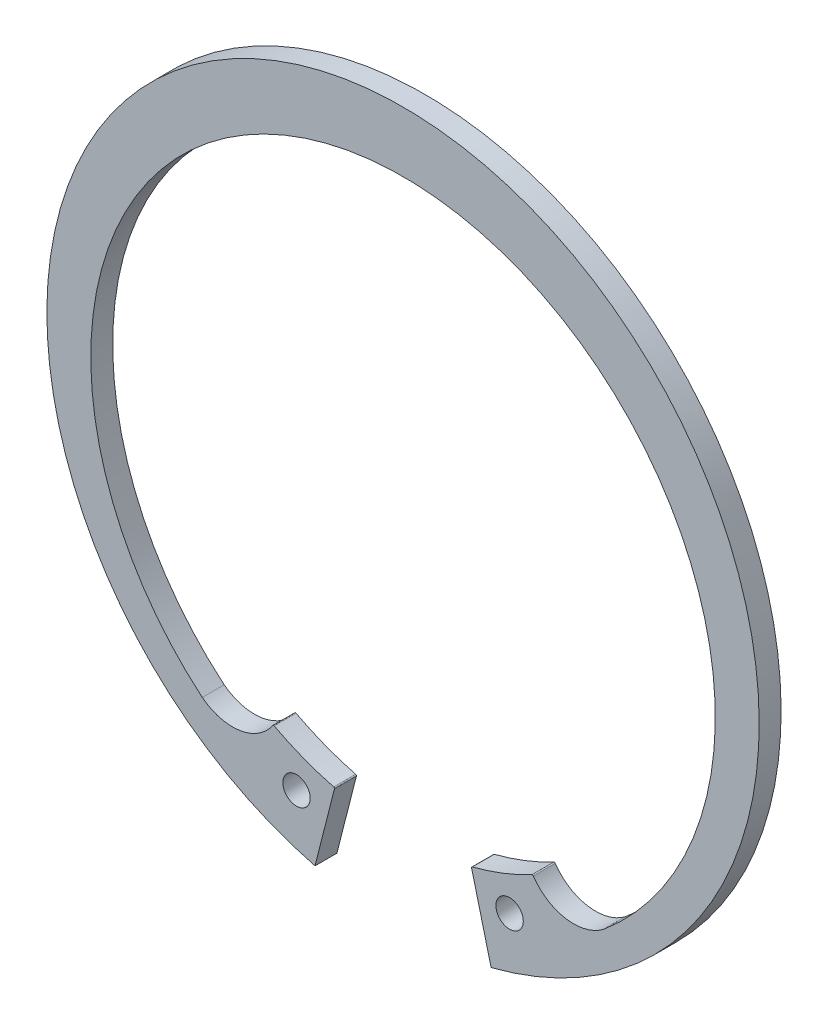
ISO-10303-21;
HEADER;
FILE_DESCRIPTION(('STEP AP214'),'2;1');
FILE_NAME('part.step','',(''),(''),'','','');
FILE_SCHEMA(('AUTOMOTIVE_DESIGN { 1 0 10303 214 1 1 1 1 }'));
ENDSEC;
DATA;
#1=APPLICATION_CONTEXT('core data for automotive mechanical design processes');
#2=APPLICATION_PROTOCOL_DEFINITION('international standard','automotive_design',2000,#1);
#3=PRODUCT_CONTEXT('',#1,'mechanical');
#4=PRODUCT('Part','Part','',(#3));
#5=PRODUCT_RELATED_PRODUCT_CATEGORY('part','',(#4));
#6=PRODUCT_DEFINITION_FORMATION('','',#4);
#7=PRODUCT_DEFINITION_CONTEXT('part definition',#1,'design');
#8=PRODUCT_DEFINITION('design','',#6,#7);
#9=PRODUCT_DEFINITION_SHAPE('','',#8);
#10=(LENGTH_UNIT() NAMED_UNIT(*) SI_UNIT(.MILLI.,.METRE.));
#11=(NAMED_UNIT(*) PLANE_ANGLE_UNIT() SI_UNIT($,.RADIAN.));
#12=(NAMED_UNIT(*) SI_UNIT($,.STERADIAN.) SOLID_ANGLE_UNIT());
#13=UNCERTAINTY_MEASURE_WITH_UNIT(LENGTH_MEASURE(1.E-05),#10,'distance_accuracy_value','');
#14=(GEOMETRIC_REPRESENTATION_CONTEXT(3) GLOBAL_UNCERTAINTY_ASSIGNED_CONTEXT((#13)) GLOBAL_UNIT_ASSIGNED_CONTEXT((#10,
#11,#12)) REPRESENTATION_CONTEXT('',''));
#15=CARTESIAN_POINT('',(0.,0.,0.));
#16=DIRECTION('',(0.,0.,1.));
#17=DIRECTION('',(1.,0.,0.));
#18=AXIS2_PLACEMENT_3D('',#15,#16,#17);
#19=CARTESIAN_POINT('',(0.,0.,-2.));
#20=DIRECTION('',(0.,0.,1.));
#21=DIRECTION('',(1.,0.,0.));
#22=AXIS2_PLACEMENT_3D('',#19,#20,#21);
#23=CYLINDRICAL_SURFACE('',#22,32.5);
#24=CARTESIAN_POINT('',(0.,0.,-2.));
#25=DIRECTION('',(0.,0.,1.));
#26=DIRECTION('',(1.,0.,0.));
#27=AXIS2_PLACEMENT_3D('',#24,#25,#26);
#28=CIRCLE('',#27,32.5);
#29=CARTESIAN_POINT('',(8.03676944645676,-31.4906388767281,-2.));
#30=VERTEX_POINT('',#29);
#31=CARTESIAN_POINT('',(-8.03676944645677,-31.4906388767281,-2.));
#32=VERTEX_POINT('',#31);
#33=EDGE_CURVE('E50',#30,#32,#28,.T.);
#34=ORIENTED_EDGE('',*,*,#33,.T.);
#35=DIRECTION('',(0.,0.,1.));
#36=VECTOR('',#35,1.);
#37=CARTESIAN_POINT('',(-8.03676944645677,-31.4906388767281,-2.));
#38=LINE('',#37,#36);
#39=CARTESIAN_POINT('',(-8.03676944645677,-31.4906388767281,0.));
#40=VERTEX_POINT('',#39);
#41=EDGE_CURVE('E37',#32,#40,#38,.T.);
#42=ORIENTED_EDGE('',*,*,#41,.T.);
#43=CARTESIAN_POINT('',(0.,0.,0.));
#44=DIRECTION('',(0.,0.,1.));
#45=DIRECTION('',(1.,0.,0.));
#46=AXIS2_PLACEMENT_3D('',#43,#44,#45);
#47=CIRCLE('',#46,32.5);
#48=CARTESIAN_POINT('',(8.03676944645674,-31.4906388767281,0.));
#49=VERTEX_POINT('',#48);
#50=EDGE_CURVE('E139',#49,#40,#47,.T.);
#51=ORIENTED_EDGE('',*,*,#50,.F.);
#52=DIRECTION('',(0.,0.,1.));
#53=VECTOR('',#52,1.);
#54=CARTESIAN_POINT('',(8.03676944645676,-31.4906388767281,-2.));
#55=LINE('',#54,#53);
#56=EDGE_CURVE('E11',#30,#49,#55,.T.);
#57=ORIENTED_EDGE('',*,*,#56,.F.);
#58=EDGE_LOOP('',(#34,#42,#51,#57));
#59=FACE_BOUND('',#58,.T.);
#60=ADVANCED_FACE('F34',(#59),#23,.T.);
#61=CARTESIAN_POINT('',(8.03676944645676,-31.4906388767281,-2.));
#62=DIRECTION('',(-0.968942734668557,-0.247285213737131,0.));
#63=DIRECTION('',(0.24728521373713,-0.968942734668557,0.));
#64=AXIS2_PLACEMENT_3D('',#61,#62,#63);
#65=PLANE('',#64);
#66=DIRECTION('',(0.24728521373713,-0.968942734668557,0.));
#67=VECTOR('',#66,1.);
#68=CARTESIAN_POINT('',(8.03676944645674,-31.4906388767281,0.));
#69=LINE('',#68,#67);
#70=CARTESIAN_POINT('',(6.25626703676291,-24.5140596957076,0.));
#71=VERTEX_POINT('',#70);
#72=EDGE_CURVE('E247',#71,#49,#69,.T.);
#73=ORIENTED_EDGE('',*,*,#72,.F.);
#74=DIRECTION('',(0.,0.,1.));
#75=VECTOR('',#74,1.);
#76=CARTESIAN_POINT('',(6.25626703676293,-24.5140596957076,-2.));
#77=LINE('',#76,#75);
#78=CARTESIAN_POINT('',(6.25626703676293,-24.5140596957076,-2.));
#79=VERTEX_POINT('',#78);
#80=EDGE_CURVE('E217',#79,#71,#77,.T.);
#81=ORIENTED_EDGE('',*,*,#80,.F.);
#82=DIRECTION('',(0.24728521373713,-0.968942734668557,0.));
#83=VECTOR('',#82,1.);
#84=CARTESIAN_POINT('',(8.03676944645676,-31.4906388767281,-2.));
#85=LINE('',#84,#83);
#86=EDGE_CURVE('E253',#79,#30,#85,.T.);
#87=ORIENTED_EDGE('',*,*,#86,.T.);
#88=ORIENTED_EDGE('',*,*,#56,.T.);
#89=EDGE_LOOP('',(#73,#81,#87,#88));
#90=FACE_BOUND('',#89,.T.);
#91=ADVANCED_FACE('F302',(#90),#65,.T.);
#92=CARTESIAN_POINT('',(0.,-1.49460272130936,-2.));
#93=DIRECTION('',(0.,0.,1.));
#94=DIRECTION('',(1.,0.,0.));
#95=AXIS2_PLACEMENT_3D('',#92,#93,#94);
#96=CYLINDRICAL_SURFACE('',#95,28.4946027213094);
#97=DIRECTION('',(0.,0.,1.));
#98=VECTOR('',#97,1.);
#99=CARTESIAN_POINT('',(-18.3186678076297,-23.3204771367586,-2.));
#100=LINE('',#99,#98);
#101=CARTESIAN_POINT('',(-18.3186678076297,-23.3204771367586,-2.));
#102=VERTEX_POINT('',#101);
#103=CARTESIAN_POINT('',(-18.3186678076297,-23.3204771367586,0.));
#104=VERTEX_POINT('',#103);
#105=EDGE_CURVE('E182',#102,#104,#100,.T.);
#106=ORIENTED_EDGE('',*,*,#105,.F.);
#107=CARTESIAN_POINT('',(0.,-1.49460272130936,-2.));
#108=DIRECTION('',(0.,0.,-1.));
#109=DIRECTION('',(1.,0.,0.));
#110=AXIS2_PLACEMENT_3D('',#107,#108,#109);
#111=CIRCLE('',#110,28.4946027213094);
#112=CARTESIAN_POINT('',(18.3186678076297,-23.3204771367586,-2.));
#113=VERTEX_POINT('',#112);
#114=EDGE_CURVE('E251',#102,#113,#111,.T.);
#115=ORIENTED_EDGE('',*,*,#114,.T.);
#116=DIRECTION('',(0.,0.,1.));
#117=VECTOR('',#116,1.);
#118=CARTESIAN_POINT('',(18.3186678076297,-23.3204771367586,-2.));
#119=LINE('',#118,#117);
#120=CARTESIAN_POINT('',(18.3186678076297,-23.3204771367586,0.));
#121=VERTEX_POINT('',#120);
#122=EDGE_CURVE('E220',#121,#113,#119,.F.);
#123=ORIENTED_EDGE('',*,*,#122,.F.);
#124=CARTESIAN_POINT('',(0.,-1.49460272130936,0.));
#125=DIRECTION('',(0.,0.,-1.));
#126=DIRECTION('',(1.,0.,0.));
#127=AXIS2_PLACEMENT_3D('',#124,#125,#126);
#128=CIRCLE('',#127,28.4946027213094);
#129=EDGE_CURVE('E141',#104,#121,#128,.T.);
#130=ORIENTED_EDGE('',*,*,#129,.F.);
#131=EDGE_LOOP('',(#106,#115,#123,#130));
#132=FACE_BOUND('',#131,.T.);
#133=ADVANCED_FACE('F281',(#132),#96,.F.);
#134=CARTESIAN_POINT('',(-8.03676944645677,-31.4906388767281,-2.));
#135=DIRECTION('',(0.968942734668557,-0.247285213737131,0.));
#136=DIRECTION('',(0.247285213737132,0.968942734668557,0.));
#137=AXIS2_PLACEMENT_3D('',#134,#135,#136);
#138=PLANE('',#137);
#139=DIRECTION('',(0.247285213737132,0.968942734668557,0.));
#140=VECTOR('',#139,1.);
#141=CARTESIAN_POINT('',(-8.03676944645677,-31.4906388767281,0.));
#142=LINE('',#141,#140);
#143=CARTESIAN_POINT('',(-6.25626703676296,-24.5140596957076,0.));
#144=VERTEX_POINT('',#143);
#145=EDGE_CURVE('E131',#40,#144,#142,.T.);
#146=ORIENTED_EDGE('',*,*,#145,.F.);
#147=ORIENTED_EDGE('',*,*,#41,.F.);
#148=DIRECTION('',(0.247285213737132,0.968942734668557,0.));
#149=VECTOR('',#148,1.);
#150=CARTESIAN_POINT('',(-8.03676944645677,-31.4906388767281,-2.));
#151=LINE('',#150,#149);
#152=CARTESIAN_POINT('',(-6.25626703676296,-24.5140596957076,-2.));
#153=VERTEX_POINT('',#152);
#154=EDGE_CURVE('E147',#32,#153,#151,.T.);
#155=ORIENTED_EDGE('',*,*,#154,.T.);
#156=DIRECTION('',(0.,0.,1.));
#157=VECTOR('',#156,1.);
#158=CARTESIAN_POINT('',(-6.25626703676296,-24.5140596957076,-2.));
#159=LINE('',#158,#157);
#160=EDGE_CURVE('E144',#153,#144,#159,.T.);
#161=ORIENTED_EDGE('',*,*,#160,.T.);
#162=EDGE_LOOP('',(#146,#147,#155,#161));
#163=FACE_BOUND('',#162,.T.);
#164=ADVANCED_FACE('F145',(#163),#138,.T.);
#165=CARTESIAN_POINT('',(0.,0.,-2.));
#166=DIRECTION('',(0.,0.,1.));
#167=DIRECTION('',(1.,0.,0.));
#168=AXIS2_PLACEMENT_3D('',#165,#166,#167);
#169=PLANE('',#168);
#170=ORIENTED_EDGE('',*,*,#114,.F.);
#171=DIRECTION('',(-0.617726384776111,-0.786393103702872,0.));
#172=VECTOR('',#171,1.);
#173=CARTESIAN_POINT('',(-20.0761075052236,-25.5577758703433,-2.));
#174=LINE('',#173,#172);
#175=CARTESIAN_POINT('',(-18.3169552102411,-23.3182969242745,-2.));
#176=VERTEX_POINT('',#175);
#177=EDGE_CURVE('E152',#176,#102,#174,.T.);
#178=ORIENTED_EDGE('',*,*,#177,.F.);
#179=CARTESIAN_POINT('',(-15.566704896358,-19.8171062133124,-2.));
#180=DIRECTION('',(0.,0.,-1.));
#181=DIRECTION('',(1.,0.,0.));
#182=AXIS2_PLACEMENT_3D('',#179,#180,#181);
#183=CIRCLE('',#182,4.45221441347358);
#184=CARTESIAN_POINT('',(-11.8858208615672,-22.321763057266,-2.));
#185=VERTEX_POINT('',#184);
#186=EDGE_CURVE('E176',#185,#176,#183,.T.);
#187=ORIENTED_EDGE('',*,*,#186,.F.);
#188=CARTESIAN_POINT('',(-11.8031455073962,-22.3780194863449,-2.));
#189=DIRECTION('',(0.,0.,1.));
#190=DIRECTION('',(1.,0.,0.));
#191=AXIS2_PLACEMENT_3D('',#188,#189,#190);
#192=CIRCLE('',#191,0.0999999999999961);
#193=CARTESIAN_POINT('',(-11.7564927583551,-22.2895688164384,-2.));
#194=VERTEX_POINT('',#193);
#195=EDGE_CURVE('E173',#194,#185,#192,.T.);
#196=ORIENTED_EDGE('',*,*,#195,.F.);
#197=CARTESIAN_POINT('',(0.,0.,-2.));
#198=DIRECTION('',(0.,0.,-1.));
#199=DIRECTION('',(1.,0.,0.));
#200=AXIS2_PLACEMENT_3D('',#197,#198,#199);
#201=CIRCLE('',#200,25.2);
#202=CARTESIAN_POINT('',(-6.32805000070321,-24.3925353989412,-2.));
#203=VERTEX_POINT('',#202);
#204=EDGE_CURVE('E171',#203,#194,#201,.T.);
#205=ORIENTED_EDGE('',*,*,#204,.F.);
#206=CARTESIAN_POINT('',(-6.35316131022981,-24.4893311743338,-2.));
#207=DIRECTION('',(0.,0.,1.));
#208=DIRECTION('',(-1.,0.,0.));
#209=AXIS2_PLACEMENT_3D('',#206,#207,#208);
#210=CIRCLE('',#209,0.0999999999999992);
#211=EDGE_CURVE('E169',#153,#203,#210,.T.);
#212=ORIENTED_EDGE('',*,*,#211,.F.);
#213=ORIENTED_EDGE('',*,*,#154,.F.);
#214=ORIENTED_EDGE('',*,*,#33,.F.);
#215=ORIENTED_EDGE('',*,*,#86,.F.);
#216=CARTESIAN_POINT('',(6.35316131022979,-24.4893311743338,-2.));
#217=DIRECTION('',(0.,0.,1.));
#218=DIRECTION('',(1.,0.,0.));
#219=AXIS2_PLACEMENT_3D('',#216,#217,#218);
#220=CIRCLE('',#219,0.0999999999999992);
#221=CARTESIAN_POINT('',(6.32805000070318,-24.3925353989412,-2.));
#222=VERTEX_POINT('',#221);
#223=EDGE_CURVE('E213',#222,#79,#220,.T.);
#224=ORIENTED_EDGE('',*,*,#223,.F.);
#225=CARTESIAN_POINT('',(0.,0.,-2.));
#226=DIRECTION('',(0.,0.,-1.));
#227=DIRECTION('',(1.,0.,0.));
#228=AXIS2_PLACEMENT_3D('',#225,#226,#227);
#229=CIRCLE('',#228,25.2);
#230=CARTESIAN_POINT('',(11.7564927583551,-22.2895688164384,-2.));
#231=VERTEX_POINT('',#230);
#232=EDGE_CURVE('E211',#231,#222,#229,.T.);
#233=ORIENTED_EDGE('',*,*,#232,.F.);
#234=CARTESIAN_POINT('',(11.8031455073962,-22.3780194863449,-2.));
#235=DIRECTION('',(0.,0.,1.));
#236=DIRECTION('',(-1.,0.,0.));
#237=AXIS2_PLACEMENT_3D('',#234,#235,#236);
#238=CIRCLE('',#237,0.0999999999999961);
#239=CARTESIAN_POINT('',(11.8858208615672,-22.321763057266,-2.));
#240=VERTEX_POINT('',#239);
#241=EDGE_CURVE('E208',#240,#231,#238,.T.);
#242=ORIENTED_EDGE('',*,*,#241,.F.);
#243=CARTESIAN_POINT('',(15.566704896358,-19.8171062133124,-2.));
#244=DIRECTION('',(0.,0.,-1.));
#245=DIRECTION('',(1.,0.,0.));
#246=AXIS2_PLACEMENT_3D('',#243,#244,#245);
#247=CIRCLE('',#246,4.45221441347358);
#248=CARTESIAN_POINT('',(18.3169552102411,-23.3182969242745,-2.));
#249=VERTEX_POINT('',#248);
#250=EDGE_CURVE('E205',#249,#240,#247,.T.);
#251=ORIENTED_EDGE('',*,*,#250,.F.);
#252=DIRECTION('',(-0.617726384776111,0.786393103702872,0.));
#253=VECTOR('',#252,1.);
#254=CARTESIAN_POINT('',(18.3169552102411,-23.3182969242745,-2.));
#255=LINE('',#254,#253);
#256=EDGE_CURVE('E203',#113,#249,#255,.T.);
#257=ORIENTED_EDGE('',*,*,#256,.F.);
#258=EDGE_LOOP('',(#170,#178,#187,#196,#205,#212,#213,#214,#215,#224,#233,#242,#251,#257));
#259=FACE_BOUND('',#258,.T.);
#260=CARTESIAN_POINT('',(9.7215445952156,-26.36477898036,-2.));
#261=DIRECTION('',(0.,0.,1.));
#262=DIRECTION('',(1.,0.,0.));
#263=AXIS2_PLACEMENT_3D('',#260,#261,#262);
#264=CIRCLE('',#263,1.25);
#265=CARTESIAN_POINT('',(10.9715445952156,-26.36477898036,-2.));
#266=VERTEX_POINT('',#265);
#267=EDGE_CURVE('E242',#266,#266,#264,.T.);
#268=ORIENTED_EDGE('',*,*,#267,.T.);
#269=EDGE_LOOP('',(#268));
#270=FACE_BOUND('',#269,.T.);
#271=CARTESIAN_POINT('',(-9.72154459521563,-26.36477898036,-2.));
#272=DIRECTION('',(0.,0.,1.));
#273=DIRECTION('',(1.,0.,0.));
#274=AXIS2_PLACEMENT_3D('',#271,#272,#273);
#275=CIRCLE('',#274,1.25);
#276=CARTESIAN_POINT('',(-8.47154459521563,-26.36477898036,-2.));
#277=VERTEX_POINT('',#276);
#278=EDGE_CURVE('E236',#277,#277,#275,.T.);
#279=ORIENTED_EDGE('',*,*,#278,.T.);
#280=EDGE_LOOP('',(#279));
#281=FACE_BOUND('',#280,.T.);
#282=ADVANCED_FACE('F259',(#259,#270,#281),#169,.F.);
#283=CARTESIAN_POINT('',(0.,0.,0.));
#284=DIRECTION('',(0.,0.,1.));
#285=DIRECTION('',(1.,0.,0.));
#286=AXIS2_PLACEMENT_3D('',#283,#284,#285);
#287=PLANE('',#286);
#288=DIRECTION('',(-0.617726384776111,-0.786393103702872,0.));
#289=VECTOR('',#288,1.);
#290=CARTESIAN_POINT('',(-20.0761075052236,-25.5577758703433,0.));
#291=LINE('',#290,#289);
#292=CARTESIAN_POINT('',(-18.3169552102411,-23.3182969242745,0.));
#293=VERTEX_POINT('',#292);
#294=EDGE_CURVE('E167',#293,#104,#291,.T.);
#295=ORIENTED_EDGE('',*,*,#294,.T.);
#296=ORIENTED_EDGE('',*,*,#129,.T.);
#297=DIRECTION('',(-0.617726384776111,0.786393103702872,0.));
#298=VECTOR('',#297,1.);
#299=CARTESIAN_POINT('',(18.3169552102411,-23.3182969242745,0.));
#300=LINE('',#299,#298);
#301=CARTESIAN_POINT('',(18.3169552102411,-23.3182969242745,0.));
#302=VERTEX_POINT('',#301);
#303=EDGE_CURVE('E190',#121,#302,#300,.T.);
#304=ORIENTED_EDGE('',*,*,#303,.T.);
#305=CARTESIAN_POINT('',(15.566704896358,-19.8171062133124,0.));
#306=DIRECTION('',(0.,0.,-1.));
#307=DIRECTION('',(1.,0.,0.));
#308=AXIS2_PLACEMENT_3D('',#305,#306,#307);
#309=CIRCLE('',#308,4.45221441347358);
#310=CARTESIAN_POINT('',(11.8858208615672,-22.321763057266,0.));
#311=VERTEX_POINT('',#310);
#312=EDGE_CURVE('E192',#302,#311,#309,.T.);
#313=ORIENTED_EDGE('',*,*,#312,.T.);
#314=CARTESIAN_POINT('',(11.8031455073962,-22.3780194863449,0.));
#315=DIRECTION('',(0.,0.,1.));
#316=DIRECTION('',(-1.,0.,0.));
#317=AXIS2_PLACEMENT_3D('',#314,#315,#316);
#318=CIRCLE('',#317,0.0999999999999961);
#319=CARTESIAN_POINT('',(11.7564927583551,-22.2895688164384,0.));
#320=VERTEX_POINT('',#319);
#321=EDGE_CURVE('E195',#311,#320,#318,.T.);
#322=ORIENTED_EDGE('',*,*,#321,.T.);
#323=CARTESIAN_POINT('',(0.,0.,0.));
#324=DIRECTION('',(0.,0.,-1.));
#325=DIRECTION('',(1.,0.,0.));
#326=AXIS2_PLACEMENT_3D('',#323,#324,#325);
#327=CIRCLE('',#326,25.2);
#328=CARTESIAN_POINT('',(6.32805000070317,-24.3925353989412,0.));
#329=VERTEX_POINT('',#328);
#330=EDGE_CURVE('E198',#320,#329,#327,.T.);
#331=ORIENTED_EDGE('',*,*,#330,.T.);
#332=CARTESIAN_POINT('',(6.35316131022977,-24.4893311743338,0.));
#333=DIRECTION('',(0.,0.,1.));
#334=DIRECTION('',(1.,0.,0.));
#335=AXIS2_PLACEMENT_3D('',#332,#333,#334);
#336=CIRCLE('',#335,0.0999999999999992);
#337=EDGE_CURVE('E200',#329,#71,#336,.T.);
#338=ORIENTED_EDGE('',*,*,#337,.T.);
#339=ORIENTED_EDGE('',*,*,#72,.T.);
#340=ORIENTED_EDGE('',*,*,#50,.T.);
#341=ORIENTED_EDGE('',*,*,#145,.T.);
#342=CARTESIAN_POINT('',(-6.35316131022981,-24.4893311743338,0.));
#343=DIRECTION('',(0.,0.,1.));
#344=DIRECTION('',(-1.,0.,0.));
#345=AXIS2_PLACEMENT_3D('',#342,#343,#344);
#346=CIRCLE('',#345,0.0999999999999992);
#347=CARTESIAN_POINT('',(-6.32805000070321,-24.3925353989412,0.));
#348=VERTEX_POINT('',#347);
#349=EDGE_CURVE('E137',#144,#348,#346,.T.);
#350=ORIENTED_EDGE('',*,*,#349,.T.);
#351=CARTESIAN_POINT('',(0.,0.,0.));
#352=DIRECTION('',(0.,0.,-1.));
#353=DIRECTION('',(1.,0.,0.));
#354=AXIS2_PLACEMENT_3D('',#351,#352,#353);
#355=CIRCLE('',#354,25.2);
#356=CARTESIAN_POINT('',(-11.7564927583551,-22.2895688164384,0.));
#357=VERTEX_POINT('',#356);
#358=EDGE_CURVE('E157',#348,#357,#355,.T.);
#359=ORIENTED_EDGE('',*,*,#358,.T.);
#360=CARTESIAN_POINT('',(-11.8031455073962,-22.3780194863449,0.));
#361=DIRECTION('',(0.,0.,1.));
#362=DIRECTION('',(1.,0.,0.));
#363=AXIS2_PLACEMENT_3D('',#360,#361,#362);
#364=CIRCLE('',#363,0.0999999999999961);
#365=CARTESIAN_POINT('',(-11.8858208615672,-22.321763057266,0.));
#366=VERTEX_POINT('',#365);
#367=EDGE_CURVE('E159',#357,#366,#364,.T.);
#368=ORIENTED_EDGE('',*,*,#367,.T.);
#369=CARTESIAN_POINT('',(-15.566704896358,-19.8171062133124,0.));
#370=DIRECTION('',(0.,0.,-1.));
#371=DIRECTION('',(1.,0.,0.));
#372=AXIS2_PLACEMENT_3D('',#369,#370,#371);
#373=CIRCLE('',#372,4.45221441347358);
#374=EDGE_CURVE('E164',#366,#293,#373,.T.);
#375=ORIENTED_EDGE('',*,*,#374,.T.);
#376=EDGE_LOOP('',(#295,#296,#304,#313,#322,#331,#338,#339,#340,#341,#350,#359,#368,#375));
#377=FACE_BOUND('',#376,.T.);
#378=CARTESIAN_POINT('',(9.72154459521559,-26.36477898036,0.));
#379=DIRECTION('',(0.,0.,1.));
#380=DIRECTION('',(1.,0.,0.));
#381=AXIS2_PLACEMENT_3D('',#378,#379,#380);
#382=CIRCLE('',#381,1.25);
#383=CARTESIAN_POINT('',(10.9715445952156,-26.36477898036,0.));
#384=VERTEX_POINT('',#383);
#385=EDGE_CURVE('E239',#384,#384,#382,.T.);
#386=ORIENTED_EDGE('',*,*,#385,.F.);
#387=EDGE_LOOP('',(#386));
#388=FACE_BOUND('',#387,.T.);
#389=CARTESIAN_POINT('',(-9.72154459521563,-26.36477898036,0.));
#390=DIRECTION('',(0.,0.,1.));
#391=DIRECTION('',(1.,0.,0.));
#392=AXIS2_PLACEMENT_3D('',#389,#390,#391);
#393=CIRCLE('',#392,1.25);
#394=CARTESIAN_POINT('',(-8.47154459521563,-26.36477898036,0.));
#395=VERTEX_POINT('',#394);
#396=EDGE_CURVE('E233',#395,#395,#393,.T.);
#397=ORIENTED_EDGE('',*,*,#396,.F.);
#398=EDGE_LOOP('',(#397));
#399=FACE_BOUND('',#398,.T.);
#400=ADVANCED_FACE('F134',(#377,#388,#399),#287,.T.);
#401=CARTESIAN_POINT('',(9.7215445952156,-26.36477898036,-2.));
#402=DIRECTION('',(0.,0.,1.));
#403=DIRECTION('',(1.,0.,0.));
#404=AXIS2_PLACEMENT_3D('',#401,#402,#403);
#405=CYLINDRICAL_SURFACE('',#404,1.25);
#406=ORIENTED_EDGE('',*,*,#267,.F.);
#407=EDGE_LOOP('',(#406));
#408=FACE_BOUND('',#407,.T.);
#409=ORIENTED_EDGE('',*,*,#385,.T.);
#410=EDGE_LOOP('',(#409));
#411=FACE_BOUND('',#410,.T.);
#412=ADVANCED_FACE('F319',(#408,#411),#405,.F.);
#413=CARTESIAN_POINT('',(-9.72154459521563,-26.36477898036,-2.));
#414=DIRECTION('',(0.,0.,1.));
#415=DIRECTION('',(1.,0.,0.));
#416=AXIS2_PLACEMENT_3D('',#413,#414,#415);
#417=CYLINDRICAL_SURFACE('',#416,1.25);
#418=ORIENTED_EDGE('',*,*,#278,.F.);
#419=EDGE_LOOP('',(#418));
#420=FACE_BOUND('',#419,.T.);
#421=ORIENTED_EDGE('',*,*,#396,.T.);
#422=EDGE_LOOP('',(#421));
#423=FACE_BOUND('',#422,.T.);
#424=ADVANCED_FACE('F323',(#420,#423),#417,.F.);
#425=CARTESIAN_POINT('',(0.,0.,-2.));
#426=DIRECTION('',(0.,0.,1.));
#427=DIRECTION('',(1.,0.,0.));
#428=AXIS2_PLACEMENT_3D('',#425,#426,#427);
#429=CYLINDRICAL_SURFACE('',#428,25.2);
#430=ORIENTED_EDGE('',*,*,#330,.F.);
#431=DIRECTION('',(0.,0.,1.));
#432=VECTOR('',#431,1.);
#433=CARTESIAN_POINT('',(11.7564927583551,-22.2895688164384,-2.));
#434=LINE('',#433,#432);
#435=EDGE_CURVE('E224',#231,#320,#434,.T.);
#436=ORIENTED_EDGE('',*,*,#435,.F.);
#437=ORIENTED_EDGE('',*,*,#232,.T.);
#438=DIRECTION('',(0.,0.,1.));
#439=VECTOR('',#438,1.);
#440=CARTESIAN_POINT('',(6.32805000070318,-24.3925353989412,-2.));
#441=LINE('',#440,#439);
#442=EDGE_CURVE('E221',#222,#329,#441,.T.);
#443=ORIENTED_EDGE('',*,*,#442,.T.);
#444=EDGE_LOOP('',(#430,#436,#437,#443));
#445=FACE_BOUND('',#444,.T.);
#446=ADVANCED_FACE('F296',(#445),#429,.F.);
#447=CARTESIAN_POINT('',(6.35316131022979,-24.4893311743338,-2.));
#448=DIRECTION('',(0.,0.,1.));
#449=DIRECTION('',(1.,0.,0.));
#450=AXIS2_PLACEMENT_3D('',#447,#448,#449);
#451=CYLINDRICAL_SURFACE('',#450,0.0999999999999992);
#452=ORIENTED_EDGE('',*,*,#337,.F.);
#453=ORIENTED_EDGE('',*,*,#442,.F.);
#454=ORIENTED_EDGE('',*,*,#223,.T.);
#455=ORIENTED_EDGE('',*,*,#80,.T.);
#456=EDGE_LOOP('',(#452,#453,#454,#455));
#457=FACE_BOUND('',#456,.T.);
#458=ADVANCED_FACE('F301',(#457),#451,.T.);
#459=CARTESIAN_POINT('',(11.8031455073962,-22.3780194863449,-2.));
#460=DIRECTION('',(0.,0.,1.));
#461=DIRECTION('',(1.,0.,0.));
#462=AXIS2_PLACEMENT_3D('',#459,#460,#461);
#463=CYLINDRICAL_SURFACE('',#462,0.0999999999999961);
#464=ORIENTED_EDGE('',*,*,#321,.F.);
#465=DIRECTION('',(0.,0.,1.));
#466=VECTOR('',#465,1.);
#467=CARTESIAN_POINT('',(11.8858208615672,-22.321763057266,-2.));
#468=LINE('',#467,#466);
#469=EDGE_CURVE('E227',#240,#311,#468,.T.);
#470=ORIENTED_EDGE('',*,*,#469,.F.);
#471=ORIENTED_EDGE('',*,*,#241,.T.);
#472=ORIENTED_EDGE('',*,*,#435,.T.);
#473=EDGE_LOOP('',(#464,#470,#471,#472));
#474=FACE_BOUND('',#473,.T.);
#475=ADVANCED_FACE('F293',(#474),#463,.T.);
#476=CARTESIAN_POINT('',(15.566704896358,-19.8171062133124,-2.));
#477=DIRECTION('',(0.,0.,1.));
#478=DIRECTION('',(1.,0.,0.));
#479=AXIS2_PLACEMENT_3D('',#476,#477,#478);
#480=CYLINDRICAL_SURFACE('',#479,4.45221441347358);
#481=ORIENTED_EDGE('',*,*,#312,.F.);
#482=DIRECTION('',(0.,0.,1.));
#483=VECTOR('',#482,1.);
#484=CARTESIAN_POINT('',(18.3169552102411,-23.3182969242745,-2.));
#485=LINE('',#484,#483);
#486=EDGE_CURVE('E216',#249,#302,#485,.T.);
#487=ORIENTED_EDGE('',*,*,#486,.F.);
#488=ORIENTED_EDGE('',*,*,#250,.T.);
#489=ORIENTED_EDGE('',*,*,#469,.T.);
#490=EDGE_LOOP('',(#481,#487,#488,#489));
#491=FACE_BOUND('',#490,.T.);
#492=ADVANCED_FACE('F290',(#491),#480,.F.);
#493=CARTESIAN_POINT('',(18.3169552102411,-23.3182969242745,-2.));
#494=DIRECTION('',(0.786393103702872,0.617726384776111,0.));
#495=DIRECTION('',(-0.617726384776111,0.786393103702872,0.));
#496=AXIS2_PLACEMENT_3D('',#493,#494,#495);
#497=PLANE('',#496);
#498=ORIENTED_EDGE('',*,*,#303,.F.);
#499=ORIENTED_EDGE('',*,*,#122,.T.);
#500=ORIENTED_EDGE('',*,*,#256,.T.);
#501=ORIENTED_EDGE('',*,*,#486,.T.);
#502=EDGE_LOOP('',(#498,#499,#500,#501));
#503=FACE_BOUND('',#502,.T.);
#504=ADVANCED_FACE('F284',(#503),#497,.T.);
#505=CARTESIAN_POINT('',(0.,0.,-2.));
#506=DIRECTION('',(0.,0.,1.));
#507=DIRECTION('',(1.,0.,0.));
#508=AXIS2_PLACEMENT_3D('',#505,#506,#507);
#509=CYLINDRICAL_SURFACE('',#508,25.2);
#510=ORIENTED_EDGE('',*,*,#358,.F.);
#511=DIRECTION('',(0.,0.,1.));
#512=VECTOR('',#511,1.);
#513=CARTESIAN_POINT('',(-6.32805000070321,-24.3925353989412,-2.));
#514=LINE('',#513,#512);
#515=EDGE_CURVE('E151',#203,#348,#514,.T.);
#516=ORIENTED_EDGE('',*,*,#515,.F.);
#517=ORIENTED_EDGE('',*,*,#204,.T.);
#518=DIRECTION('',(0.,0.,1.));
#519=VECTOR('',#518,1.);
#520=CARTESIAN_POINT('',(-11.7564927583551,-22.2895688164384,-2.));
#521=LINE('',#520,#519);
#522=EDGE_CURVE('E185',#194,#357,#521,.T.);
#523=ORIENTED_EDGE('',*,*,#522,.T.);
#524=EDGE_LOOP('',(#510,#516,#517,#523));
#525=FACE_BOUND('',#524,.T.);
#526=ADVANCED_FACE('F265',(#525),#509,.F.);
#527=CARTESIAN_POINT('',(-20.0761075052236,-25.5577758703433,-2.));
#528=DIRECTION('',(-0.786393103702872,0.617726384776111,0.));
#529=DIRECTION('',(-0.617726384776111,-0.786393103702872,0.));
#530=AXIS2_PLACEMENT_3D('',#527,#528,#529);
#531=PLANE('',#530);
#532=ORIENTED_EDGE('',*,*,#177,.T.);
#533=ORIENTED_EDGE('',*,*,#105,.T.);
#534=ORIENTED_EDGE('',*,*,#294,.F.);
#535=DIRECTION('',(0.,0.,1.));
#536=VECTOR('',#535,1.);
#537=CARTESIAN_POINT('',(-18.3169552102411,-23.3182969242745,-2.));
#538=LINE('',#537,#536);
#539=EDGE_CURVE('E180',#176,#293,#538,.T.);
#540=ORIENTED_EDGE('',*,*,#539,.F.);
#541=EDGE_LOOP('',(#532,#533,#534,#540));
#542=FACE_BOUND('',#541,.T.);
#543=ADVANCED_FACE('F275',(#542),#531,.T.);
#544=CARTESIAN_POINT('',(-15.566704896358,-19.8171062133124,-2.));
#545=DIRECTION('',(0.,0.,1.));
#546=DIRECTION('',(1.,0.,0.));
#547=AXIS2_PLACEMENT_3D('',#544,#545,#546);
#548=CYLINDRICAL_SURFACE('',#547,4.45221441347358);
#549=ORIENTED_EDGE('',*,*,#374,.F.);
#550=DIRECTION('',(0.,0.,1.));
#551=VECTOR('',#550,1.);
#552=CARTESIAN_POINT('',(-11.8858208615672,-22.321763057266,-2.));
#553=LINE('',#552,#551);
#554=EDGE_CURVE('E183',#185,#366,#553,.T.);
#555=ORIENTED_EDGE('',*,*,#554,.F.);
#556=ORIENTED_EDGE('',*,*,#186,.T.);
#557=ORIENTED_EDGE('',*,*,#539,.T.);
#558=EDGE_LOOP('',(#549,#555,#556,#557));
#559=FACE_BOUND('',#558,.T.);
#560=ADVANCED_FACE('F272',(#559),#548,.F.);
#561=CARTESIAN_POINT('',(-11.8031455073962,-22.3780194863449,-2.));
#562=DIRECTION('',(0.,0.,1.));
#563=DIRECTION('',(1.,0.,0.));
#564=AXIS2_PLACEMENT_3D('',#561,#562,#563);
#565=CYLINDRICAL_SURFACE('',#564,0.0999999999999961);
#566=ORIENTED_EDGE('',*,*,#367,.F.);
#567=ORIENTED_EDGE('',*,*,#522,.F.);
#568=ORIENTED_EDGE('',*,*,#195,.T.);
#569=ORIENTED_EDGE('',*,*,#554,.T.);
#570=EDGE_LOOP('',(#566,#567,#568,#569));
#571=FACE_BOUND('',#570,.T.);
#572=ADVANCED_FACE('F270',(#571),#565,.T.);
#573=CARTESIAN_POINT('',(-6.35316131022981,-24.4893311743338,-2.));
#574=DIRECTION('',(0.,0.,1.));
#575=DIRECTION('',(1.,0.,0.));
#576=AXIS2_PLACEMENT_3D('',#573,#574,#575);
#577=CYLINDRICAL_SURFACE('',#576,0.0999999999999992);
#578=ORIENTED_EDGE('',*,*,#349,.F.);
#579=ORIENTED_EDGE('',*,*,#160,.F.);
#580=ORIENTED_EDGE('',*,*,#211,.T.);
#581=ORIENTED_EDGE('',*,*,#515,.T.);
#582=EDGE_LOOP('',(#578,#579,#580,#581));
#583=FACE_BOUND('',#582,.T.);
#584=ADVANCED_FACE('F155',(#583),#577,.T.);
#585=CLOSED_SHELL('',(#60,#91,#133,#164,#282,#400,#412,#424,#446,#458,#475,#492,#504,#526,#543,
#560,#572,#584));
#586=MANIFOLD_SOLID_BREP('B2',#585);
#587=ADVANCED_BREP_SHAPE_REPRESENTATION('',(#18,#586),#14);
#588=SHAPE_DEFINITION_REPRESENTATION(#9,#587);
ENDSEC;
END-ISO-10303-21;
